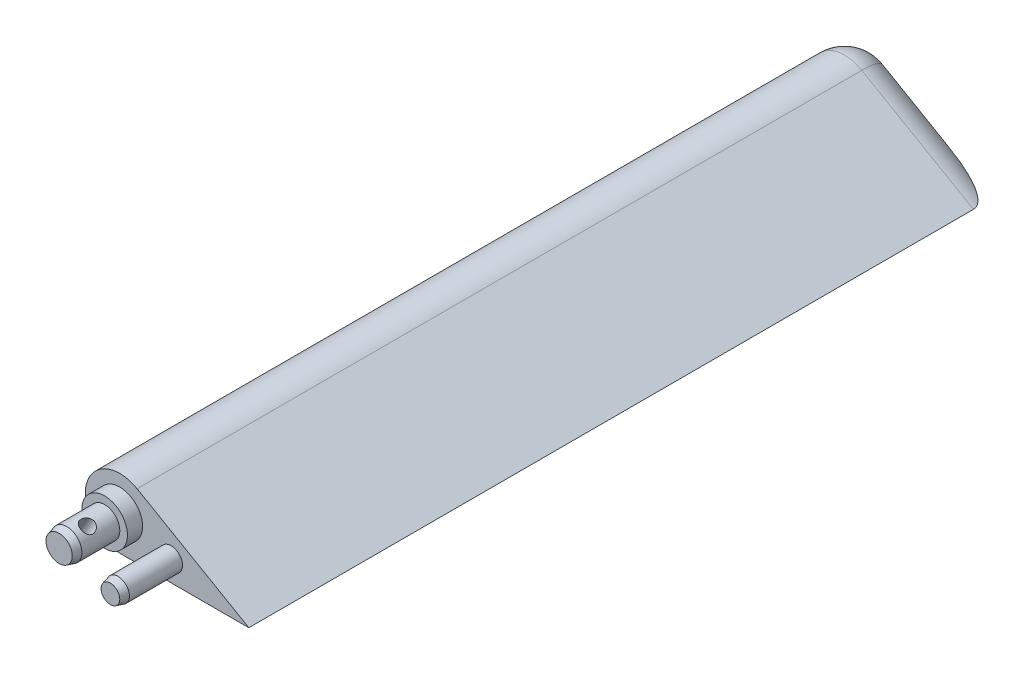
ISO-10303-21;
HEADER;
FILE_DESCRIPTION(('STEP AP214'),'2;1');
FILE_NAME('part.step','',(''),(''),'','','');
FILE_SCHEMA(('AUTOMOTIVE_DESIGN { 1 0 10303 214 1 1 1 1 }'));
ENDSEC;
DATA;
#1=APPLICATION_CONTEXT('core data for automotive mechanical design processes');
#2=APPLICATION_PROTOCOL_DEFINITION('international standard','automotive_design',2000,#1);
#3=PRODUCT_CONTEXT('',#1,'mechanical');
#4=PRODUCT('Part','Part','',(#3));
#5=PRODUCT_RELATED_PRODUCT_CATEGORY('part','',(#4));
#6=PRODUCT_DEFINITION_FORMATION('','',#4);
#7=PRODUCT_DEFINITION_CONTEXT('part definition',#1,'design');
#8=PRODUCT_DEFINITION('design','',#6,#7);
#9=PRODUCT_DEFINITION_SHAPE('','',#8);
#10=(LENGTH_UNIT() NAMED_UNIT(*) SI_UNIT(.MILLI.,.METRE.));
#11=(NAMED_UNIT(*) PLANE_ANGLE_UNIT() SI_UNIT($,.RADIAN.));
#12=(NAMED_UNIT(*) SI_UNIT($,.STERADIAN.) SOLID_ANGLE_UNIT());
#13=UNCERTAINTY_MEASURE_WITH_UNIT(LENGTH_MEASURE(1.E-05),#10,'distance_accuracy_value','');
#14=(GEOMETRIC_REPRESENTATION_CONTEXT(3) GLOBAL_UNCERTAINTY_ASSIGNED_CONTEXT((#13)) GLOBAL_UNIT_ASSIGNED_CONTEXT((#10,
#11,#12)) REPRESENTATION_CONTEXT('',''));
#15=CARTESIAN_POINT('',(0.,0.,0.));
#16=DIRECTION('',(0.,0.,1.));
#17=DIRECTION('',(1.,0.,0.));
#18=AXIS2_PLACEMENT_3D('',#15,#16,#17);
#19=CARTESIAN_POINT('',(-38.282150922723,22.7756813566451,500.));
#20=DIRECTION('',(0.,0.,1.));
#21=DIRECTION('',(1.,0.,0.));
#22=AXIS2_PLACEMENT_3D('',#19,#20,#21);
#23=PLANE('',#22);
#24=CARTESIAN_POINT('',(-38.282150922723,22.7756813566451,500.));
#25=DIRECTION('',(0.,0.,1.));
#26=DIRECTION('',(1.,0.,0.));
#27=AXIS2_PLACEMENT_3D('',#24,#25,#26);
#28=CIRCLE('',#27,15.);
#29=CARTESIAN_POINT('',(-23.282150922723,22.7756813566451,500.));
#30=VERTEX_POINT('',#29);
#31=EDGE_CURVE('E212',#30,#30,#28,.T.);
#32=ORIENTED_EDGE('',*,*,#31,.F.);
#33=EDGE_LOOP('',(#32));
#34=FACE_BOUND('',#33,.T.);
#35=CARTESIAN_POINT('',(-38.282150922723,22.7756813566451,500.));
#36=DIRECTION('',(0.,0.,1.));
#37=DIRECTION('',(1.,0.,0.));
#38=AXIS2_PLACEMENT_3D('',#35,#36,#37);
#39=CIRCLE('',#38,22.7756813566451);
#40=CARTESIAN_POINT('',(-26.8943102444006,42.4999999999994,500.));
#41=VERTEX_POINT('',#40);
#42=CARTESIAN_POINT('',(-38.282150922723,0.,500.));
#43=VERTEX_POINT('',#42);
#44=EDGE_CURVE('E88',#41,#43,#39,.T.);
#45=ORIENTED_EDGE('',*,*,#44,.T.);
#46=DIRECTION('',(1.,0.,0.));
#47=VECTOR('',#46,1.);
#48=CARTESIAN_POINT('',(-38.282150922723,0.,500.));
#49=LINE('',#48,#47);
#50=CARTESIAN_POINT('',(46.717849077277,0.,500.));
#51=VERTEX_POINT('',#50);
#52=EDGE_CURVE('E78',#43,#51,#49,.T.);
#53=ORIENTED_EDGE('',*,*,#52,.T.);
#54=DIRECTION('',(-0.866025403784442,0.499999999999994,0.));
#55=VECTOR('',#54,1.);
#56=CARTESIAN_POINT('',(46.717849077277,0.,500.));
#57=LINE('',#56,#55);
#58=EDGE_CURVE('E87',#51,#41,#57,.T.);
#59=ORIENTED_EDGE('',*,*,#58,.T.);
#60=EDGE_LOOP('',(#45,#53,#59));
#61=FACE_BOUND('',#60,.T.);
#62=CARTESIAN_POINT('',(-4.47474700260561,13.717014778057,500.));
#63=DIRECTION('',(0.,0.,1.));
#64=DIRECTION('',(1.,0.,0.));
#65=AXIS2_PLACEMENT_3D('',#62,#63,#64);
#66=CIRCLE('',#65,7.5);
#67=CARTESIAN_POINT('',(3.02525299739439,13.717014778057,500.));
#68=VERTEX_POINT('',#67);
#69=EDGE_CURVE('E220',#68,#68,#66,.T.);
#70=ORIENTED_EDGE('',*,*,#69,.F.);
#71=EDGE_LOOP('',(#70));
#72=FACE_BOUND('',#71,.T.);
#73=ADVANCED_FACE('F31',(#34,#61,#72),#23,.T.);
#74=CARTESIAN_POINT('',(-38.282150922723,22.7756813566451,510.));
#75=DIRECTION('',(0.,0.,1.));
#76=DIRECTION('',(1.,0.,0.));
#77=AXIS2_PLACEMENT_3D('',#74,#75,#76);
#78=PLANE('',#77);
#79=CARTESIAN_POINT('',(-38.282150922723,22.7756813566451,510.));
#80=DIRECTION('',(0.,0.,1.));
#81=DIRECTION('',(1.,0.,0.));
#82=AXIS2_PLACEMENT_3D('',#79,#80,#81);
#83=CIRCLE('',#82,15.);
#84=CARTESIAN_POINT('',(-23.282150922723,22.7756813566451,510.));
#85=VERTEX_POINT('',#84);
#86=EDGE_CURVE('E93',#85,#85,#83,.T.);
#87=ORIENTED_EDGE('',*,*,#86,.T.);
#88=EDGE_LOOP('',(#87));
#89=FACE_BOUND('',#88,.T.);
#90=CARTESIAN_POINT('',(-38.282150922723,22.7756813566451,510.));
#91=DIRECTION('',(0.,0.,1.));
#92=DIRECTION('',(1.,0.,0.));
#93=AXIS2_PLACEMENT_3D('',#90,#91,#92);
#94=CIRCLE('',#93,10.);
#95=CARTESIAN_POINT('',(-28.282150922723,22.7756813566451,510.));
#96=VERTEX_POINT('',#95);
#97=EDGE_CURVE('E215',#96,#96,#94,.T.);
#98=ORIENTED_EDGE('',*,*,#97,.F.);
#99=EDGE_LOOP('',(#98));
#100=FACE_BOUND('',#99,.T.);
#101=ADVANCED_FACE('F144',(#89,#100),#78,.T.);
#102=CARTESIAN_POINT('',(-38.282150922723,22.7756813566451,500.));
#103=DIRECTION('',(0.,0.,-1.));
#104=DIRECTION('',(-1.,0.,0.));
#105=AXIS2_PLACEMENT_3D('',#102,#103,#104);
#106=CYLINDRICAL_SURFACE('',#105,22.7756813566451);
#107=DIRECTION('',(0.,0.,-1.));
#108=VECTOR('',#107,1.);
#109=CARTESIAN_POINT('',(-26.8943102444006,42.4999999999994,500.));
#110=LINE('',#109,#108);
#111=CARTESIAN_POINT('',(-26.8943102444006,42.4999999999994,22.5));
#112=VERTEX_POINT('',#111);
#113=EDGE_CURVE('E101',#41,#112,#110,.T.);
#114=ORIENTED_EDGE('',*,*,#113,.T.);
#115=CARTESIAN_POINT('',(-38.282150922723,22.7756813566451,22.5));
#116=DIRECTION('',(0.,0.,1.));
#117=DIRECTION('',(1.,0.,0.));
#118=AXIS2_PLACEMENT_3D('',#115,#116,#117);
#119=CIRCLE('',#118,22.7756813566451);
#120=CARTESIAN_POINT('',(-38.282150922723,0.,22.5));
#121=VERTEX_POINT('',#120);
#122=EDGE_CURVE('E46',#112,#121,#119,.T.);
#123=ORIENTED_EDGE('',*,*,#122,.T.);
#124=DIRECTION('',(0.,0.,-1.));
#125=VECTOR('',#124,1.);
#126=CARTESIAN_POINT('',(-38.282150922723,0.,500.));
#127=LINE('',#126,#125);
#128=EDGE_CURVE('E81',#43,#121,#127,.T.);
#129=ORIENTED_EDGE('',*,*,#128,.F.);
#130=ORIENTED_EDGE('',*,*,#44,.F.);
#131=EDGE_LOOP('',(#114,#123,#129,#130));
#132=FACE_BOUND('',#131,.T.);
#133=ADVANCED_FACE('F95',(#132),#106,.T.);
#134=CARTESIAN_POINT('',(-38.282150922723,0.,500.));
#135=DIRECTION('',(0.,1.,0.));
#136=DIRECTION('',(-1.,0.,0.));
#137=AXIS2_PLACEMENT_3D('',#134,#135,#136);
#138=PLANE('',#137);
#139=ORIENTED_EDGE('',*,*,#128,.T.);
#140=DIRECTION('',(1.,0.,0.));
#141=VECTOR('',#140,1.);
#142=CARTESIAN_POINT('',(-38.282150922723,0.,22.5));
#143=LINE('',#142,#141);
#144=CARTESIAN_POINT('',(46.717849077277,0.,22.5));
#145=VERTEX_POINT('',#144);
#146=EDGE_CURVE('E191',#121,#145,#143,.T.);
#147=ORIENTED_EDGE('',*,*,#146,.T.);
#148=DIRECTION('',(0.,0.,-1.));
#149=VECTOR('',#148,1.);
#150=CARTESIAN_POINT('',(46.717849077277,0.,500.));
#151=LINE('',#150,#149);
#152=EDGE_CURVE('E84',#51,#145,#151,.T.);
#153=ORIENTED_EDGE('',*,*,#152,.F.);
#154=ORIENTED_EDGE('',*,*,#52,.F.);
#155=EDGE_LOOP('',(#139,#147,#153,#154));
#156=FACE_BOUND('',#155,.T.);
#157=ADVANCED_FACE('F80',(#156),#138,.F.);
#158=CARTESIAN_POINT('',(46.717849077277,0.,500.));
#159=DIRECTION('',(-0.499999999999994,-0.866025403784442,0.));
#160=DIRECTION('',(0.866025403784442,-0.499999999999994,0.));
#161=AXIS2_PLACEMENT_3D('',#158,#159,#160);
#162=PLANE('',#161);
#163=ORIENTED_EDGE('',*,*,#152,.T.);
#164=DIRECTION('',(-0.866025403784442,0.499999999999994,0.));
#165=VECTOR('',#164,1.);
#166=CARTESIAN_POINT('',(46.717849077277,0.,22.5));
#167=LINE('',#166,#165);
#168=EDGE_CURVE('E96',#145,#112,#167,.T.);
#169=ORIENTED_EDGE('',*,*,#168,.T.);
#170=ORIENTED_EDGE('',*,*,#113,.F.);
#171=ORIENTED_EDGE('',*,*,#58,.F.);
#172=EDGE_LOOP('',(#163,#169,#170,#171));
#173=FACE_BOUND('',#172,.T.);
#174=ADVANCED_FACE('F157',(#173),#162,.F.);
#175=CARTESIAN_POINT('',(-38.282150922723,22.7756813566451,0.));
#176=DIRECTION('',(0.,0.,1.));
#177=DIRECTION('',(1.,0.,0.));
#178=AXIS2_PLACEMENT_3D('',#175,#176,#177);
#179=PLANE('',#178);
#180=CARTESIAN_POINT('',(-38.282150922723,22.7756813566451,0.));
#181=DIRECTION('',(0.,0.,1.));
#182=DIRECTION('',(1.,0.,0.));
#183=AXIS2_PLACEMENT_3D('',#180,#181,#182);
#184=CIRCLE('',#183,0.275681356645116);
#185=CARTESIAN_POINT('',(-38.282150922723,22.4999999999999,0.));
#186=VERTEX_POINT('',#185);
#187=CARTESIAN_POINT('',(-38.1443102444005,23.0144284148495,0.));
#188=VERTEX_POINT('',#187);
#189=EDGE_CURVE('E99',#186,#188,#184,.F.);
#190=ORIENTED_EDGE('',*,*,#189,.T.);
#191=DIRECTION('',(-0.866025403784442,0.499999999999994,0.));
#192=VECTOR('',#191,1.);
#193=CARTESIAN_POINT('',(-38.1443102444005,23.0144284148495,0.));
#194=LINE('',#193,#192);
#195=CARTESIAN_POINT('',(-37.2532940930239,22.4999999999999,0.));
#196=VERTEX_POINT('',#195);
#197=EDGE_CURVE('E202',#188,#196,#194,.F.);
#198=ORIENTED_EDGE('',*,*,#197,.T.);
#199=DIRECTION('',(1.,0.,0.));
#200=VECTOR('',#199,1.);
#201=CARTESIAN_POINT('',(-38.282150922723,22.4999999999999,0.));
#202=LINE('',#201,#200);
#203=EDGE_CURVE('E205',#196,#186,#202,.F.);
#204=ORIENTED_EDGE('',*,*,#203,.T.);
#205=EDGE_LOOP('',(#190,#198,#204));
#206=FACE_BOUND('',#205,.T.);
#207=ADVANCED_FACE('F154',(#206),#179,.F.);
#208=CARTESIAN_POINT('',(-38.282150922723,22.7756813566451,510.));
#209=DIRECTION('',(0.,0.,-1.));
#210=DIRECTION('',(-1.,0.,0.));
#211=AXIS2_PLACEMENT_3D('',#208,#209,#210);
#212=CYLINDRICAL_SURFACE('',#211,15.);
#213=ORIENTED_EDGE('',*,*,#86,.F.);
#214=EDGE_LOOP('',(#213));
#215=FACE_BOUND('',#214,.T.);
#216=ORIENTED_EDGE('',*,*,#31,.T.);
#217=EDGE_LOOP('',(#216));
#218=FACE_BOUND('',#217,.T.);
#219=ADVANCED_FACE('F140',(#215,#218),#212,.T.);
#220=CARTESIAN_POINT('',(-38.282150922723,22.7756813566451,540.));
#221=DIRECTION('',(0.,0.,-1.));
#222=DIRECTION('',(-1.,0.,0.));
#223=AXIS2_PLACEMENT_3D('',#220,#221,#222);
#224=CYLINDRICAL_SURFACE('',#223,10.);
#225=CARTESIAN_POINT('',(-38.282150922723,22.7756813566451,534.999999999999));
#226=DIRECTION('',(0.,0.,1.));
#227=DIRECTION('',(1.,0.,0.));
#228=AXIS2_PLACEMENT_3D('',#225,#226,#227);
#229=CIRCLE('',#228,10.);
#230=CARTESIAN_POINT('',(-28.282150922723,22.7756813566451,534.999999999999));
#231=VERTEX_POINT('',#230);
#232=EDGE_CURVE('E11',#231,#231,#229,.F.);
#233=ORIENTED_EDGE('',*,*,#232,.T.);
#234=EDGE_LOOP('',(#233));
#235=FACE_BOUND('',#234,.T.);
#236=CARTESIAN_POINT('',(-46.6444080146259,17.2918272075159,526.17273664));
#237=CARTESIAN_POINT('',(-46.6444077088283,17.2918257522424,526.291759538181));
#238=CARTESIAN_POINT('',(-46.6415064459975,17.2873946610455,526.410813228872));
#239=CARTESIAN_POINT('',(-46.6299068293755,17.2697683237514,526.648034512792));
#240=CARTESIAN_POINT('',(-46.6212050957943,17.2565679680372,526.766201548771));
#241=CARTESIAN_POINT('',(-46.5980005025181,17.2216659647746,527.000938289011));
#242=CARTESIAN_POINT('',(-46.5834864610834,17.1999479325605,527.117504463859));
#243=CARTESIAN_POINT('',(-46.5486927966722,17.1484938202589,527.347992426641));
#244=CARTESIAN_POINT('',(-46.5284107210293,17.1187543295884,527.461913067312));
#245=CARTESIAN_POINT('',(-46.459182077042,17.018704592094,527.797439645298));
#246=CARTESIAN_POINT('',(-46.4017216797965,16.937353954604,528.014148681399));
#247=CARTESIAN_POINT('',(-46.2643383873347,16.7508986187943,528.429154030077));
#248=CARTESIAN_POINT('',(-46.1844182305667,16.6457968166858,528.627452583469));
#249=CARTESIAN_POINT('',(-45.9961029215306,16.4102152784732,529.014690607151));
#250=CARTESIAN_POINT('',(-45.8861737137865,16.2785166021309,529.202142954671));
#251=CARTESIAN_POINT('',(-45.6406965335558,16.0017667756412,529.548558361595));
#252=CARTESIAN_POINT('',(-45.5051377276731,15.8567099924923,529.707509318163));
#253=CARTESIAN_POINT('',(-45.2792984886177,15.63060327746,529.925202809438));
#254=CARTESIAN_POINT('',(-45.1979579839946,15.5517563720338,529.995764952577));
#255=CARTESIAN_POINT('',(-45.028562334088,15.3933136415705,530.127306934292));
#256=CARTESIAN_POINT('',(-44.9405099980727,15.3137181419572,530.188290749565));
#257=CARTESIAN_POINT('',(-44.7579744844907,15.1547653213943,530.300116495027));
#258=CARTESIAN_POINT('',(-44.6634909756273,15.0754080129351,530.350957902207));
#259=CARTESIAN_POINT('',(-44.4685800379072,14.9179606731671,530.441935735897));
#260=CARTESIAN_POINT('',(-44.3681557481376,14.8398699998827,530.482077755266));
#261=CARTESIAN_POINT('',(-44.1680233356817,14.6904374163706,530.549166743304));
#262=CARTESIAN_POINT('',(-44.0686235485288,14.6189693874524,530.576753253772));
#263=CARTESIAN_POINT('',(-43.8657361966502,14.4787680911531,530.621729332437));
#264=CARTESIAN_POINT('',(-43.7622505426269,14.4100335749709,530.639123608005));
#265=CARTESIAN_POINT('',(-43.5519269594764,14.2759749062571,530.663519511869));
#266=CARTESIAN_POINT('',(-43.4450896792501,14.2106501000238,530.67052313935));
#267=CARTESIAN_POINT('',(-43.2289039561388,14.0839999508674,530.674055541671));
#268=CARTESIAN_POINT('',(-43.1195556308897,14.0226744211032,530.670584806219));
#269=CARTESIAN_POINT('',(-42.9071132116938,13.9087084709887,530.653832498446));
#270=CARTESIAN_POINT('',(-42.8041267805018,13.8557605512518,530.64126553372));
#271=CARTESIAN_POINT('',(-42.597535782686,13.7540009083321,530.607263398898));
#272=CARTESIAN_POINT('',(-42.493931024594,13.705190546,530.585825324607));
#273=CARTESIAN_POINT('',(-42.2869528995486,13.61192474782,530.534303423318));
#274=CARTESIAN_POINT('',(-42.1835794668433,13.5674678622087,530.50422248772));
#275=CARTESIAN_POINT('',(-41.9777902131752,13.4829608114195,530.435703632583));
#276=CARTESIAN_POINT('',(-41.875374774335,13.4429123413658,530.397262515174));
#277=CARTESIAN_POINT('',(-41.5677035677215,13.3282826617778,530.268618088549));
#278=CARTESIAN_POINT('',(-41.3649912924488,13.2605387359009,530.165835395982));
#279=CARTESIAN_POINT('',(-40.9725133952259,13.1421914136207,529.930331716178));
#280=CARTESIAN_POINT('',(-40.7827525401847,13.0915943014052,529.797599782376));
#281=CARTESIAN_POINT('',(-40.4067848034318,13.0019315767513,529.493637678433));
#282=CARTESIAN_POINT('',(-40.2220839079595,12.964116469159,529.320173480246));
#283=CARTESIAN_POINT('',(-39.8799219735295,12.9026164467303,528.945683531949));
#284=CARTESIAN_POINT('',(-39.7224751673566,12.878938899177,528.744643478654));
#285=CARTESIAN_POINT('',(-39.5086466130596,12.8509044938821,528.421152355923));
#286=CARTESIAN_POINT('',(-39.4399088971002,12.8427208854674,528.307022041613));
#287=CARTESIAN_POINT('',(-39.3125600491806,12.8287040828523,528.073127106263));
#288=CARTESIAN_POINT('',(-39.2539444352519,12.8228698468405,527.953365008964));
#289=CARTESIAN_POINT('',(-39.1477380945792,12.8130708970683,527.709004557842));
#290=CARTESIAN_POINT('',(-39.1001448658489,12.8091057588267,527.584407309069));
#291=CARTESIAN_POINT('',(-39.0168138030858,12.8026166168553,527.331332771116));
#292=CARTESIAN_POINT('',(-38.9810693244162,12.8000918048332,527.202857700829));
#293=CARTESIAN_POINT('',(-38.9242049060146,12.7962766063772,526.952323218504));
#294=CARTESIAN_POINT('',(-38.9022233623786,12.7949109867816,526.830460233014));
#295=CARTESIAN_POINT('',(-38.8694626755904,12.7929294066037,526.585282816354));
#296=CARTESIAN_POINT('',(-38.8586782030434,12.7923130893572,526.461969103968));
#297=CARTESIAN_POINT('',(-38.8485030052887,12.7917306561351,526.214892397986));
#298=CARTESIAN_POINT('',(-38.8491102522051,12.7917644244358,526.091129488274));
#299=CARTESIAN_POINT('',(-38.861700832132,12.7924874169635,525.844191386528));
#300=CARTESIAN_POINT('',(-38.8736836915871,12.7931766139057,525.721016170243));
#301=CARTESIAN_POINT('',(-38.9073844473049,12.7952333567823,525.48612067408));
#302=CARTESIAN_POINT('',(-38.9282421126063,12.7965419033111,525.374275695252));
#303=CARTESIAN_POINT('',(-38.9790544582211,12.7999626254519,525.152673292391));
#304=CARTESIAN_POINT('',(-39.0090120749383,12.8020750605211,525.042916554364));
#305=CARTESIAN_POINT('',(-39.1119235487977,12.8099260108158,524.717857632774));
#306=CARTESIAN_POINT('',(-39.1979412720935,12.8171790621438,524.506596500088));
#307=CARTESIAN_POINT('',(-39.4050731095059,12.8383633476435,524.09060618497));
#308=CARTESIAN_POINT('',(-39.5275956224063,12.8525811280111,523.886601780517));
#309=CARTESIAN_POINT('',(-39.8008432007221,12.8907138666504,523.499377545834));
#310=CARTESIAN_POINT('',(-39.9515817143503,12.9146334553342,523.316167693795));
#311=CARTESIAN_POINT('',(-40.2920425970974,12.9780709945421,522.957087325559));
#312=CARTESIAN_POINT('',(-40.484136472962,13.0188864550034,522.783690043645));
#313=CARTESIAN_POINT('',(-40.8896296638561,13.1193607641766,522.470066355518));
#314=CARTESIAN_POINT('',(-41.103032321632,13.1790225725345,522.329845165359));
#315=CARTESIAN_POINT('',(-41.4345062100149,13.2848226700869,522.147196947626));
#316=CARTESIAN_POINT('',(-41.5475472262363,13.3230638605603,522.090694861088));
#317=CARTESIAN_POINT('',(-41.7761576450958,13.4051622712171,521.987832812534));
#318=CARTESIAN_POINT('',(-41.891725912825,13.4490170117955,521.941468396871));
#319=CARTESIAN_POINT('',(-42.1242948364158,13.5423918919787,521.859396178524));
#320=CARTESIAN_POINT('',(-42.2412949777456,13.5919100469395,521.823684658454));
#321=CARTESIAN_POINT('',(-42.4756533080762,13.6965296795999,521.763324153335));
#322=CARTESIAN_POINT('',(-42.593011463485,13.7516306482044,521.738674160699));
#323=CARTESIAN_POINT('',(-42.8176625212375,13.8625693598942,521.702259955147));
#324=CARTESIAN_POINT('',(-42.9250156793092,13.9180022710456,521.689629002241));
#325=CARTESIAN_POINT('',(-43.1382175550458,14.0330677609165,521.67415631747));
#326=CARTESIAN_POINT('',(-43.2440657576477,14.0927017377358,521.671317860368));
#327=CARTESIAN_POINT('',(-43.4533092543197,14.2156673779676,521.675473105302));
#328=CARTESIAN_POINT('',(-43.5567059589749,14.2789968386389,521.682461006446));
#329=CARTESIAN_POINT('',(-43.7603719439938,14.4088606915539,521.706179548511));
#330=CARTESIAN_POINT('',(-43.8606400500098,14.4753962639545,521.722913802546));
#331=CARTESIAN_POINT('',(-44.0527213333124,14.6078493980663,521.764932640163));
#332=CARTESIAN_POINT('',(-44.1447106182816,14.673650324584,521.789780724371));
#333=CARTESIAN_POINT('',(-44.3247001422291,14.8069817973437,521.847910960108));
#334=CARTESIAN_POINT('',(-44.4126989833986,14.8745129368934,521.881196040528));
#335=CARTESIAN_POINT('',(-44.6700060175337,15.0787284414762,521.993264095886));
#336=CARTESIAN_POINT('',(-44.8327839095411,15.2171456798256,522.08429527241));
#337=CARTESIAN_POINT('',(-45.1452972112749,15.4994394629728,522.30089382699));
#338=CARTESIAN_POINT('',(-45.2940938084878,15.643275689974,522.427852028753));
#339=CARTESIAN_POINT('',(-45.5687849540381,15.9241427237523,522.710849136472));
#340=CARTESIAN_POINT('',(-45.6946695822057,16.061170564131,522.866900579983));
#341=CARTESIAN_POINT('',(-45.9323945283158,16.3329358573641,523.21839415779));
#342=CARTESIAN_POINT('',(-46.0422739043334,16.4665905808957,523.416002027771));
#343=CARTESIAN_POINT('',(-46.2348788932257,16.7111584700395,523.837327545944));
#344=CARTESIAN_POINT('',(-46.3175870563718,16.8220570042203,524.061061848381));
#345=CARTESIAN_POINT('',(-46.4212563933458,16.9654780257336,524.412715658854));
#346=CARTESIAN_POINT('',(-46.4524899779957,17.0095819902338,524.533076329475));
#347=CARTESIAN_POINT('',(-46.5079762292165,17.0890171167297,524.778199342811));
#348=CARTESIAN_POINT('',(-46.532232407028,17.1243526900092,524.902959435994));
#349=CARTESIAN_POINT('',(-46.5736680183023,17.1853234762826,525.155612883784));
#350=CARTESIAN_POINT('',(-46.5908660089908,17.2109841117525,525.283497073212));
#351=CARTESIAN_POINT('',(-46.6182255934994,17.252052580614,525.541578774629));
#352=CARTESIAN_POINT('',(-46.6283924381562,17.2674680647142,525.671774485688));
#353=CARTESIAN_POINT('',(-46.6381570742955,17.2823047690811,525.864050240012));
#354=CARTESIAN_POINT('',(-46.6405007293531,17.2858729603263,525.925705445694));
#355=CARTESIAN_POINT('',(-46.643626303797,17.2906345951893,526.049149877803));
#356=CARTESIAN_POINT('',(-46.6444081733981,17.2918279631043,526.110939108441));
#357=CARTESIAN_POINT('',(-46.6444080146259,17.2918272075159,526.17273664));
#358=B_SPLINE_CURVE_WITH_KNOTS('',3,(#236,#237,#238,#239,#240,#241,#242,#243,#244,#245,#246,
#247,#248,#249,#250,#251,#252,#253,#254,#255,#256,#257,#258,#259,#260,#261,#262,#263,#264,#265,
#266,#267,#268,#269,#270,#271,#272,#273,#274,#275,#276,#277,#278,#279,#280,#281,#282,#283,#284,
#285,#286,#287,#288,#289,#290,#291,#292,#293,#294,#295,#296,#297,#298,#299,#300,#301,#302,#303,
#304,#305,#306,#307,#308,#309,#310,#311,#312,#313,#314,#315,#316,#317,#318,#319,#320,#321,#322,
#323,#324,#325,#326,#327,#328,#329,#330,#331,#332,#333,#334,#335,#336,#337,#338,#339,#340,#341,
#342,#343,#344,#345,#346,#347,#348,#349,#350,#351,#352,#353,#354,#355,#356,#357),.UNSPECIFIED.,
.T.,.F.,(4,2,2,2,2,2,2,2,2,2,2,2,2,2,2,2,2,2,2,2,2,2,2,2,2,2,2,2,2,2,2,2,2,2,2,2,2,2,2,2,2,2,2,
2,2,2,2,2,2,2,2,2,2,2,2,2,2,2,2,2,4),(0.,0.357004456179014,0.714217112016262,1.07212030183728,
1.43017590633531,2.14225562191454,2.85424855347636,3.61334582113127,4.37276467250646,
4.77272074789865,5.17251032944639,5.57232052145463,5.97192131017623,6.34790934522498,
6.72372358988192,7.09946551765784,7.47518987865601,7.82421803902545,8.17336055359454,
8.52238640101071,8.87154599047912,9.579746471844,10.2882062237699,11.0534929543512,
11.8191781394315,12.2191905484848,12.6190253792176,13.0187693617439,13.4182887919,
13.7892978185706,14.1601301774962,14.530896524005,14.9016474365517,15.2425875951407,
15.5836378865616,16.265228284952,16.9775711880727,17.6902544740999,18.4726889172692,
19.2552462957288,19.6509088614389,20.0463972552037,20.4417474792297,20.8370616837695,
21.2010314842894,21.5651229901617,21.9289996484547,22.2930112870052,22.6399982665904,
22.9871058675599,23.6807366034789,24.4061360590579,25.1318488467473,25.9162900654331,
26.7012340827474,27.096592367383,27.4917513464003,27.885864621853,28.2796832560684,
28.465036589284,28.6503958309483),.UNSPECIFIED.);
#359=CARTESIAN_POINT('',(-46.6444080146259,17.2918272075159,526.17273664));
#360=VERTEX_POINT('',#359);
#361=EDGE_CURVE('E112',#360,#360,#358,.T.);
#362=ORIENTED_EDGE('',*,*,#361,.T.);
#363=EDGE_LOOP('',(#362));
#364=FACE_BOUND('',#363,.T.);
#365=CARTESIAN_POINT('',(-37.7141224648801,32.7595355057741,526.17273664));
#366=CARTESIAN_POINT('',(-37.7141210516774,32.7595359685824,526.053713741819));
#367=CARTESIAN_POINT('',(-37.708832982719,32.7592389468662,525.934660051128));
#368=CARTESIAN_POINT('',(-37.6877683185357,32.7580065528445,525.697438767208));
#369=CARTESIAN_POINT('',(-37.6719856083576,32.7570708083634,525.579271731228));
#370=CARTESIAN_POINT('',(-37.6301572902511,32.754426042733,525.344534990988));
#371=CARTESIAN_POINT('',(-37.6040919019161,32.752715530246,525.227968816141));
#372=CARTESIAN_POINT('',(-37.5421345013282,32.748310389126,524.997480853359));
#373=CARTESIAN_POINT('',(-37.5062383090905,32.745615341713,524.883560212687));
#374=CARTESIAN_POINT('',(-37.3849783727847,32.7356864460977,524.548033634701));
#375=CARTESIAN_POINT('',(-37.2857964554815,32.7265996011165,524.331324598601));
#376=CARTESIAN_POINT('',(-37.0556297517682,32.7008498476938,523.916319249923));
#377=CARTESIAN_POINT('',(-36.9246488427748,32.6841878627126,523.71802069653));
#378=CARTESIAN_POINT('',(-36.6264715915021,32.6388927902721,523.330782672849));
#379=CARTESIAN_POINT('',(-36.4574525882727,32.609540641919,523.143330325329));
#380=CARTESIAN_POINT('',(-36.0950416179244,32.5353260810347,522.796914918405));
#381=CARTESIAN_POINT('',(-35.9016393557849,32.4904571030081,522.637963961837));
#382=CARTESIAN_POINT('',(-35.5929055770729,32.4079279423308,522.420270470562));
#383=CARTESIAN_POINT('',(-35.4839519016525,32.3769084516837,522.349708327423));
#384=CARTESIAN_POINT('',(-35.262038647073,32.3094288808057,522.218166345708));
#385=CARTESIAN_POINT('',(-35.1490807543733,32.2729710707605,522.157182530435));
#386=CARTESIAN_POINT('',(-34.9201558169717,32.1943670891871,522.045356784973));
#387=CARTESIAN_POINT('',(-34.8041886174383,32.1522206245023,521.994515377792));
#388=CARTESIAN_POINT('',(-34.5703797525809,32.0621464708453,521.903537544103));
#389=CARTESIAN_POINT('',(-34.4525391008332,32.0142218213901,521.863395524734));
#390=CARTESIAN_POINT('',(-34.2230604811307,31.9156183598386,521.796306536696));
#391=CARTESIAN_POINT('',(-34.1114674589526,31.8652696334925,521.768720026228));
#392=CARTESIAN_POINT('',(-33.8886058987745,31.7596646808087,521.723743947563));
#393=CARTESIAN_POINT('',(-33.7773372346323,31.7044107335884,521.706349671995));
#394=CARTESIAN_POINT('',(-33.5560772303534,31.589294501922,521.681953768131));
#395=CARTESIAN_POINT('',(-33.4460856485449,31.5294331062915,521.67495014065));
#396=CARTESIAN_POINT('',(-33.2283105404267,31.4055358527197,521.671417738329));
#397=CARTESIAN_POINT('',(-33.1205269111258,31.3415001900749,521.674888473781));
#398=CARTESIAN_POINT('',(-32.9156082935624,31.2145026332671,521.691640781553));
#399=CARTESIAN_POINT('',(-32.8182608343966,31.1517877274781,521.70420774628));
#400=CARTESIAN_POINT('',(-32.6268388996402,31.0237544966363,521.738209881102));
#401=CARTESIAN_POINT('',(-32.5327655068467,30.9584353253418,521.759647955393));
#402=CARTESIAN_POINT('',(-32.3485058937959,30.8258199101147,521.811169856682));
#403=CARTESIAN_POINT('',(-32.2583183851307,30.7585243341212,521.84125079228));
#404=CARTESIAN_POINT('',(-32.0822385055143,30.6225591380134,521.909769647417));
#405=CARTESIAN_POINT('',(-31.996347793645,30.5538890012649,521.948210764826));
#406=CARTESIAN_POINT('',(-31.7432399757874,30.3447527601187,522.076855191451));
#407=CARTESIAN_POINT('',(-31.5832158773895,30.203070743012,522.179637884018));
#408=CARTESIAN_POINT('',(-31.2844851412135,29.9223485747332,522.415141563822));
#409=CARTESIAN_POINT('',(-31.1457863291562,29.7833094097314,522.547873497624));
#410=CARTESIAN_POINT('',(-30.880152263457,29.502543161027,522.851835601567));
#411=CARTESIAN_POINT('',(-30.755052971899,29.3614950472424,523.025299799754));
#412=CARTESIAN_POINT('',(-30.5307114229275,29.0959241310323,523.399789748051));
#413=CARTESIAN_POINT('',(-30.4314826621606,28.9714099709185,523.600829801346));
#414=CARTESIAN_POINT('',(-30.3002898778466,28.8002462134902,523.924320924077));
#415=CARTESIAN_POINT('',(-30.2588338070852,28.7448094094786,524.038451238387));
#416=CARTESIAN_POINT('',(-30.1830204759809,28.6415304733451,524.272346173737));
#417=CARTESIAN_POINT('',(-30.1486600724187,28.5936849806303,524.392108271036));
#418=CARTESIAN_POINT('',(-30.0870707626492,28.506607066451,524.636468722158));
#419=CARTESIAN_POINT('',(-30.0598402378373,28.4673726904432,524.761065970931));
#420=CARTESIAN_POINT('',(-30.0125549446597,28.3984504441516,525.014140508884));
#421=CARTESIAN_POINT('',(-29.992496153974,28.3687572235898,525.142615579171));
#422=CARTESIAN_POINT('',(-29.9607598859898,28.3214187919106,525.393150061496));
#423=CARTESIAN_POINT('',(-29.9485864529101,28.3030650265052,525.515013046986));
#424=CARTESIAN_POINT('',(-29.9304900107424,28.2756842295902,525.760190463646));
#425=CARTESIAN_POINT('',(-29.9245640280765,28.2666527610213,525.883504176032));
#426=CARTESIAN_POINT('',(-29.9189720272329,28.2581319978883,526.130580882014));
#427=CARTESIAN_POINT('',(-29.9193048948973,28.2586410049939,526.254343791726));
#428=CARTESIAN_POINT('',(-29.9262263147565,28.2691832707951,526.501281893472));
#429=CARTESIAN_POINT('',(-29.9328146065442,28.279216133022,526.624457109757));
#430=CARTESIAN_POINT('',(-29.9514461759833,28.3073734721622,526.85935260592));
#431=CARTESIAN_POINT('',(-29.96300824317,28.3247824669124,526.971197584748));
#432=CARTESIAN_POINT('',(-29.9913768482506,28.3670768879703,527.192799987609));
#433=CARTESIAN_POINT('',(-30.008185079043,28.3919647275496,527.302556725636));
#434=CARTESIAN_POINT('',(-30.0664399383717,28.4771632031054,527.627615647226));
#435=CARTESIAN_POINT('',(-30.1157301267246,28.5480302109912,527.838876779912));
#436=CARTESIAN_POINT('',(-30.2376421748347,28.7168195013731,528.25486709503));
#437=CARTESIAN_POINT('',(-30.3112163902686,28.8158182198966,528.458871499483));
#438=CARTESIAN_POINT('',(-30.480864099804,29.033391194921,528.846095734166));
#439=CARTESIAN_POINT('',(-30.5769483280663,29.1519747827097,529.029305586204));
#440=CARTESIAN_POINT('',(-30.8021172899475,29.4151037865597,529.388385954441));
#441=CARTESIAN_POINT('',(-30.9335114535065,29.5610542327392,529.561783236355));
#442=CARTESIAN_POINT('',(-31.2232713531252,29.8619844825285,529.875406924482));
#443=CARTESIAN_POINT('',(-31.3816413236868,30.0169657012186,530.015628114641));
#444=CARTESIAN_POINT('',(-31.6390038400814,30.2511304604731,530.198276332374));
#445=CARTESIAN_POINT('',(-31.7286421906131,30.3299062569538,530.254778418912));
#446=CARTESIAN_POINT('',(-31.9140467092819,30.4868394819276,530.357640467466));
#447=CARTESIAN_POINT('',(-32.0098101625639,30.5649971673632,530.404004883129));
#448=CARTESIAN_POINT('',(-32.2069596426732,30.719720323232,530.486077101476));
#449=CARTESIAN_POINT('',(-32.3083436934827,30.7962863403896,530.521788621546));
#450=CARTESIAN_POINT('',(-32.5161261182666,30.9469367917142,530.582149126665));
#451=CARTESIAN_POINT('',(-32.6225240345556,31.0210214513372,530.6067991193));
#452=CARTESIAN_POINT('',(-32.8309253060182,31.160105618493,530.643213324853));
#453=CARTESIAN_POINT('',(-32.932608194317,31.2253597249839,530.655844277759));
#454=CARTESIAN_POINT('',(-33.1388587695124,31.3524652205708,530.67131696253));
#455=CARTESIAN_POINT('',(-33.2434274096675,31.4143154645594,530.674155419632));
#456=CARTESIAN_POINT('',(-33.4545405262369,31.5340428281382,530.670000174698));
#457=CARTESIAN_POINT('',(-33.5610838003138,31.5919222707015,530.663012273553));
#458=CARTESIAN_POINT('',(-33.775382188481,31.7033702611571,530.639293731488));
#459=CARTESIAN_POINT('',(-33.8831377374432,31.7569372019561,530.622559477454));
#460=CARTESIAN_POINT('',(-34.0938861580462,31.8570579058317,530.580540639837));
#461=CARTESIAN_POINT('',(-34.1968660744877,31.9038225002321,530.555692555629));
#462=CARTESIAN_POINT('',(-34.4023292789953,31.9930322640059,530.497562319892));
#463=CARTESIAN_POINT('',(-34.5048123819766,32.0354759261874,530.464277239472));
#464=CARTESIAN_POINT('',(-34.8103217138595,32.1562026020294,530.352209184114));
#465=CARTESIAN_POINT('',(-35.0115835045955,32.2279637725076,530.26117800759));
#466=CARTESIAN_POINT('',(-35.4123137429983,32.3574613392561,530.04457945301));
#467=CARTESIAN_POINT('',(-35.6112778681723,32.4144048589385,529.917621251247));
#468=CARTESIAN_POINT('',(-35.991861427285,32.5118608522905,529.634624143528));
#469=CARTESIAN_POINT('',(-36.1734733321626,32.5523662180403,529.478572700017));
#470=CARTESIAN_POINT('',(-36.5276914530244,32.6223594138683,529.12707912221));
#471=CARTESIAN_POINT('',(-36.6983795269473,32.6506903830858,528.929471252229));
#472=CARTESIAN_POINT('',(-37.0064840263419,32.6952072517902,528.508145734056));
#473=CARTESIAN_POINT('',(-37.1438790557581,32.7113853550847,528.284411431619));
#474=CARTESIAN_POINT('',(-37.3199199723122,32.729455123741,527.932757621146));
#475=CARTESIAN_POINT('',(-37.373731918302,32.734452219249,527.812396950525));
#476=CARTESIAN_POINT('',(-37.4702678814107,32.742787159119,527.567273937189));
#477=CARTESIAN_POINT('',(-37.5129974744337,32.7461258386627,527.442513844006));
#478=CARTESIAN_POINT('',(-37.5865175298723,32.7515247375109,527.189860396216));
#479=CARTESIAN_POINT('',(-37.6173392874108,32.7535883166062,527.061976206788));
#480=CARTESIAN_POINT('',(-37.6665854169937,32.756748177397,526.803894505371));
#481=CARTESIAN_POINT('',(-37.6850190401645,32.7578451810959,526.673698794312));
#482=CARTESIAN_POINT('',(-37.7027503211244,32.7588832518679,526.481423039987));
#483=CARTESIAN_POINT('',(-37.707012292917,32.7591288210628,526.419767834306));
#484=CARTESIAN_POINT('',(-37.7126987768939,32.7594548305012,526.296323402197));
#485=CARTESIAN_POINT('',(-37.7141231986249,32.7595352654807,526.234534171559));
#486=CARTESIAN_POINT('',(-37.7141224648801,32.7595355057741,526.17273664));
#487=B_SPLINE_CURVE_WITH_KNOTS('',3,(#365,#366,#367,#368,#369,#370,#371,#372,#373,#374,#375,
#376,#377,#378,#379,#380,#381,#382,#383,#384,#385,#386,#387,#388,#389,#390,#391,#392,#393,#394,
#395,#396,#397,#398,#399,#400,#401,#402,#403,#404,#405,#406,#407,#408,#409,#410,#411,#412,#413,
#414,#415,#416,#417,#418,#419,#420,#421,#422,#423,#424,#425,#426,#427,#428,#429,#430,#431,#432,
#433,#434,#435,#436,#437,#438,#439,#440,#441,#442,#443,#444,#445,#446,#447,#448,#449,#450,#451,
#452,#453,#454,#455,#456,#457,#458,#459,#460,#461,#462,#463,#464,#465,#466,#467,#468,#469,#470,
#471,#472,#473,#474,#475,#476,#477,#478,#479,#480,#481,#482,#483,#484,#485,#486),.UNSPECIFIED.,
.T.,.F.,(4,2,2,2,2,2,2,2,2,2,2,2,2,2,2,2,2,2,2,2,2,2,2,2,2,2,2,2,2,2,2,2,2,2,2,2,2,2,2,2,2,2,2,
2,2,2,2,2,2,2,2,2,2,2,2,2,2,2,2,2,4),(0.,0.357004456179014,0.714217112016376,1.07212030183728,
1.43017590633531,2.14225562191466,2.85424855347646,3.61334582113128,4.37276467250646,
4.7727207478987,5.1725103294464,5.57232052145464,5.97192131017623,6.34790934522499,
6.72372358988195,7.09946551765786,7.47518987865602,7.82421803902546,8.17336055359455,
8.52238640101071,8.87154599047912,9.57974647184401,10.2882062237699,11.0534929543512,
11.8191781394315,12.2191905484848,12.6190253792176,13.0187693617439,13.4182887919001,
13.7892978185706,14.1601301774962,14.530896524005,14.9016474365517,15.242587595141,
15.5836378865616,16.2652282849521,16.9775711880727,17.6902544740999,18.4726889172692,
19.2552462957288,19.6509088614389,20.0463972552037,20.4417474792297,20.8370616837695,
21.2010314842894,21.5651229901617,21.9289996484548,22.2930112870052,22.6399982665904,
22.9871058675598,23.6807366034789,24.4061360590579,25.1318488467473,25.9162900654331,
26.7012340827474,27.096592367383,27.4917513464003,27.885864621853,28.2796832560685,
28.4650365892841,28.6503958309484),.UNSPECIFIED.);
#488=CARTESIAN_POINT('',(-37.7141224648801,32.7595355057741,526.17273664));
#489=VERTEX_POINT('',#488);
#490=EDGE_CURVE('E105',#489,#489,#487,.T.);
#491=ORIENTED_EDGE('',*,*,#490,.T.);
#492=EDGE_LOOP('',(#491));
#493=FACE_BOUND('',#492,.T.);
#494=ORIENTED_EDGE('',*,*,#97,.T.);
#495=EDGE_LOOP('',(#494));
#496=FACE_BOUND('',#495,.T.);
#497=ADVANCED_FACE('F116',(#235,#364,#493,#496),#224,.T.);
#498=CARTESIAN_POINT('',(-38.282150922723,22.7756813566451,540.));
#499=DIRECTION('',(0.,0.,1.));
#500=DIRECTION('',(1.,0.,0.));
#501=AXIS2_PLACEMENT_3D('',#498,#499,#500);
#502=PLANE('',#501);
#503=CARTESIAN_POINT('',(-38.282150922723,22.7756813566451,540.));
#504=DIRECTION('',(0.,0.,1.));
#505=DIRECTION('',(1.,0.,0.));
#506=AXIS2_PLACEMENT_3D('',#503,#504,#505);
#507=CIRCLE('',#506,8.66025403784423);
#508=CARTESIAN_POINT('',(-29.6218968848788,22.7756813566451,540.));
#509=VERTEX_POINT('',#508);
#510=EDGE_CURVE('E39',#509,#509,#507,.T.);
#511=ORIENTED_EDGE('',*,*,#510,.T.);
#512=EDGE_LOOP('',(#511));
#513=FACE_BOUND('',#512,.T.);
#514=ADVANCED_FACE('F133',(#513),#502,.T.);
#515=CARTESIAN_POINT('',(-4.47474700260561,13.717014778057,540.));
#516=DIRECTION('',(0.,0.,-1.));
#517=DIRECTION('',(-1.,0.,0.));
#518=AXIS2_PLACEMENT_3D('',#515,#516,#517);
#519=CYLINDRICAL_SURFACE('',#518,7.5);
#520=CARTESIAN_POINT('',(-4.47474700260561,13.717014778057,535.));
#521=DIRECTION('',(0.,0.,1.));
#522=DIRECTION('',(1.,0.,0.));
#523=AXIS2_PLACEMENT_3D('',#520,#521,#522);
#524=CIRCLE('',#523,7.5);
#525=CARTESIAN_POINT('',(3.02525299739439,13.717014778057,535.));
#526=VERTEX_POINT('',#525);
#527=EDGE_CURVE('E185',#526,#526,#524,.F.);
#528=ORIENTED_EDGE('',*,*,#527,.T.);
#529=EDGE_LOOP('',(#528));
#530=FACE_BOUND('',#529,.T.);
#531=ORIENTED_EDGE('',*,*,#69,.T.);
#532=EDGE_LOOP('',(#531));
#533=FACE_BOUND('',#532,.T.);
#534=ADVANCED_FACE('F130',(#530,#533),#519,.T.);
#535=CARTESIAN_POINT('',(-4.47474700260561,13.717014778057,540.));
#536=DIRECTION('',(0.,0.,1.));
#537=DIRECTION('',(1.,0.,0.));
#538=AXIS2_PLACEMENT_3D('',#535,#536,#537);
#539=PLANE('',#538);
#540=CARTESIAN_POINT('',(-4.47474700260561,13.717014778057,540.));
#541=DIRECTION('',(0.,0.,1.));
#542=DIRECTION('',(1.,0.,0.));
#543=AXIS2_PLACEMENT_3D('',#540,#541,#542);
#544=CIRCLE('',#543,6.16025403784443);
#545=CARTESIAN_POINT('',(1.68550703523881,13.717014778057,540.));
#546=VERTEX_POINT('',#545);
#547=EDGE_CURVE('E188',#546,#546,#544,.T.);
#548=ORIENTED_EDGE('',*,*,#547,.T.);
#549=EDGE_LOOP('',(#548));
#550=FACE_BOUND('',#549,.T.);
#551=ADVANCED_FACE('F125',(#550),#539,.T.);
#552=CARTESIAN_POINT('',(-26.8943102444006,42.4999999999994,526.17273664));
#553=DIRECTION('',(0.499999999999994,0.866025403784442,0.));
#554=DIRECTION('',(-0.866025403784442,0.499999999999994,0.));
#555=AXIS2_PLACEMENT_3D('',#552,#553,#554);
#556=CYLINDRICAL_SURFACE('',#555,4.49999999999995);
#557=ORIENTED_EDGE('',*,*,#490,.F.);
#558=EDGE_LOOP('',(#557));
#559=FACE_BOUND('',#558,.T.);
#560=ORIENTED_EDGE('',*,*,#361,.F.);
#561=EDGE_LOOP('',(#560));
#562=FACE_BOUND('',#561,.T.);
#563=ADVANCED_FACE('F120',(#559,#562),#556,.F.);
#564=CARTESIAN_POINT('',(-38.282150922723,22.4999999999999,22.5));
#565=DIRECTION('',(1.,0.,0.));
#566=DIRECTION('',(0.,1.,0.));
#567=AXIS2_PLACEMENT_3D('',#564,#565,#566);
#568=CYLINDRICAL_SURFACE('',#567,22.5);
#569=CARTESIAN_POINT('',(-37.253294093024,22.5,22.5));
#570=DIRECTION('',(0.258819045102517,0.965925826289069,0.));
#571=DIRECTION('',(0.965925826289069,-0.258819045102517,0.));
#572=AXIS2_PLACEMENT_3D('',#569,#570,#571);
#573=ELLIPSE('',#572,86.9333243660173,22.5);
#574=EDGE_CURVE('E54',#145,#196,#573,.T.);
#575=ORIENTED_EDGE('',*,*,#574,.F.);
#576=ORIENTED_EDGE('',*,*,#146,.F.);
#577=CARTESIAN_POINT('',(-38.282150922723,22.4999999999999,22.5));
#578=DIRECTION('',(-1.,0.,0.));
#579=DIRECTION('',(0.,0.,1.));
#580=AXIS2_PLACEMENT_3D('',#577,#578,#579);
#581=CIRCLE('',#580,22.5);
#582=EDGE_CURVE('E113',#186,#121,#581,.T.);
#583=ORIENTED_EDGE('',*,*,#582,.F.);
#584=ORIENTED_EDGE('',*,*,#203,.F.);
#585=EDGE_LOOP('',(#575,#576,#583,#584));
#586=FACE_BOUND('',#585,.T.);
#587=ADVANCED_FACE('F124',(#586),#568,.T.);
#588=CARTESIAN_POINT('',(-38.282150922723,22.7756813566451,22.5));
#589=DIRECTION('',(0.,0.,1.));
#590=DIRECTION('',(1.,0.,0.));
#591=AXIS2_PLACEMENT_3D('',#588,#589,#590);
#592=DEGENERATE_TOROIDAL_SURFACE('',#591,0.275681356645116,22.5,.T.);
#593=ORIENTED_EDGE('',*,*,#582,.T.);
#594=ORIENTED_EDGE('',*,*,#122,.F.);
#595=CARTESIAN_POINT('',(-38.1443102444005,23.0144284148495,22.5));
#596=DIRECTION('',(0.866025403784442,-0.499999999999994,0.));
#597=DIRECTION('',(0.499999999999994,0.866025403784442,0.));
#598=AXIS2_PLACEMENT_3D('',#595,#596,#597);
#599=CIRCLE('',#598,22.5);
#600=EDGE_CURVE('E199',#188,#112,#599,.T.);
#601=ORIENTED_EDGE('',*,*,#600,.F.);
#602=ORIENTED_EDGE('',*,*,#189,.F.);
#603=EDGE_LOOP('',(#593,#594,#601,#602));
#604=FACE_BOUND('',#603,.T.);
#605=ADVANCED_FACE('F170',(#604),#592,.T.);
#606=CARTESIAN_POINT('',(35.4678490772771,-19.48557158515,22.5));
#607=DIRECTION('',(-0.866025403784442,0.499999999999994,0.));
#608=DIRECTION('',(-0.499999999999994,-0.866025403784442,0.));
#609=AXIS2_PLACEMENT_3D('',#606,#607,#608);
#610=CYLINDRICAL_SURFACE('',#609,22.5);
#611=ORIENTED_EDGE('',*,*,#574,.T.);
#612=ORIENTED_EDGE('',*,*,#197,.F.);
#613=ORIENTED_EDGE('',*,*,#600,.T.);
#614=ORIENTED_EDGE('',*,*,#168,.F.);
#615=EDGE_LOOP('',(#611,#612,#613,#614));
#616=FACE_BOUND('',#615,.T.);
#617=ADVANCED_FACE('F166',(#616),#610,.T.);
#618=CARTESIAN_POINT('',(-4.47474700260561,13.717014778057,540.));
#619=DIRECTION('',(0.,0.,-1.));
#620=DIRECTION('',(-1.,0.,0.));
#621=AXIS2_PLACEMENT_3D('',#618,#619,#620);
#622=CONICAL_SURFACE('',#621,6.16025403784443,0.261799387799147);
#623=ORIENTED_EDGE('',*,*,#527,.F.);
#624=EDGE_LOOP('',(#623));
#625=FACE_BOUND('',#624,.T.);
#626=ORIENTED_EDGE('',*,*,#547,.F.);
#627=EDGE_LOOP('',(#626));
#628=FACE_BOUND('',#627,.T.);
#629=ADVANCED_FACE('F169',(#625,#628),#622,.T.);
#630=CARTESIAN_POINT('',(-38.282150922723,22.7756813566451,540.));
#631=DIRECTION('',(0.,0.,-1.));
#632=DIRECTION('',(-1.,0.,0.));
#633=AXIS2_PLACEMENT_3D('',#630,#631,#632);
#634=CONICAL_SURFACE('',#633,8.66025403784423,0.261799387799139);
#635=ORIENTED_EDGE('',*,*,#232,.F.);
#636=EDGE_LOOP('',(#635));
#637=FACE_BOUND('',#636,.T.);
#638=ORIENTED_EDGE('',*,*,#510,.F.);
#639=EDGE_LOOP('',(#638));
#640=FACE_BOUND('',#639,.T.);
#641=ADVANCED_FACE('F33',(#637,#640),#634,.T.);
#642=CLOSED_SHELL('',(#73,#101,#133,#157,#174,#207,#219,#497,#514,#534,#551,#563,#587,#605,#617,
#629,#641));
#643=MANIFOLD_SOLID_BREP('B2',#642);
#644=ADVANCED_BREP_SHAPE_REPRESENTATION('',(#18,#643),#14);
#645=SHAPE_DEFINITION_REPRESENTATION(#9,#644);
ENDSEC;
END-ISO-10303-21;
